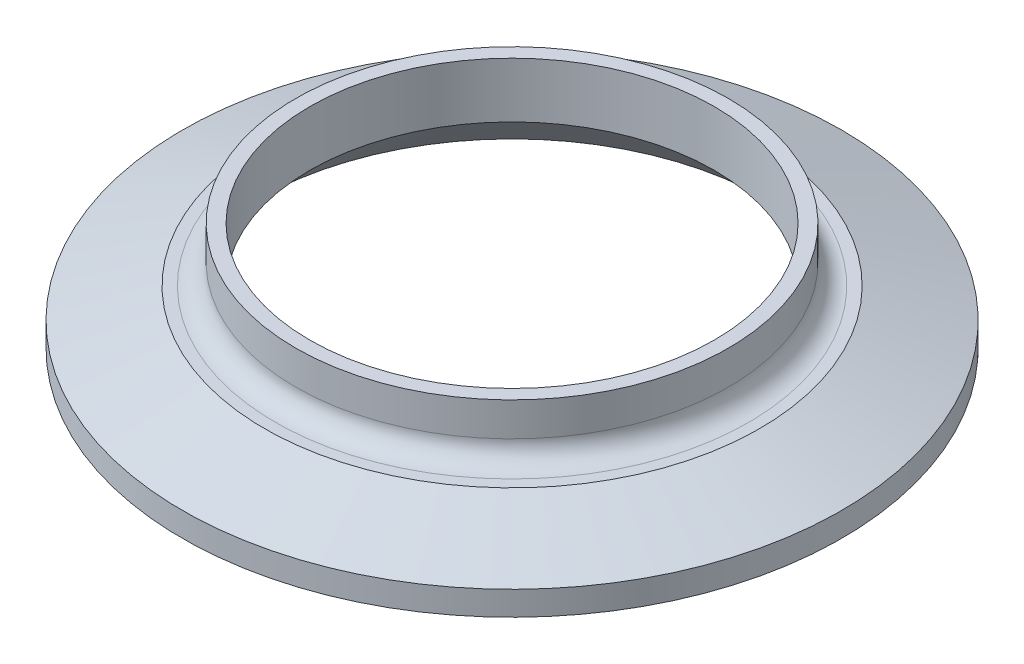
from build123d import *


with BuildPart() as part:
    # Sketch1 → Revolve1 (revolve)
    with BuildSketch(Plane.XY, mode=Mode.PRIVATE) as revolve1_sk:
        with BuildLine():
            Line((-25.4, 12.7), (-25.4, 8.7376))
            ThreePointArc((-25.4, 8.7376), (-26.099311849, 7.049311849), (-27.7876, 6.35))
            Line((-27.7876, 6.35), (-29.066442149, 6.35))
            Line((-29.066442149, 6.35), (-38.6969, 2.8448))
            Line((-38.6969, 2.8448), (-38.6969, 0))
            Line((-38.6969, 0), (-36.902872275, 0.002512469))
            ThreePointArc((-36.902872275, 0.002512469), (-36.468277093, 0.133310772), (-36.178066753, 0.482250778))
            Line((-36.178066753, 0.482250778), (-36.073244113, 0.729197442))
            ThreePointArc((-36.073244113, 0.729197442), (-35.3187, 1.228619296), (-34.564155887, 0.729197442))
            Line((-34.564155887, 0.729197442), (-34.397287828, 0.336080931))
            ThreePointArc((-34.397287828, 0.336080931), (-34.107077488, -0.012859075), (-33.672482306, -0.143657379))
            Line((-33.672482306, -0.143657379), (-30.099, 0))
            Line((-30.099, 0), (-23.749, 6.218379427))
            Line((-23.749, 6.218379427), (-23.749, 12.7))
            Line((-23.749, 12.7), (-25.4, 12.7))
        make_face()
    revolve(revolve1_sk.sketch.rotate(Axis((0, 0, 0), (0, 1, 0)), 270), axis=Axis((0, 0, 0), (0, 1, 0)))


solid = part.part
